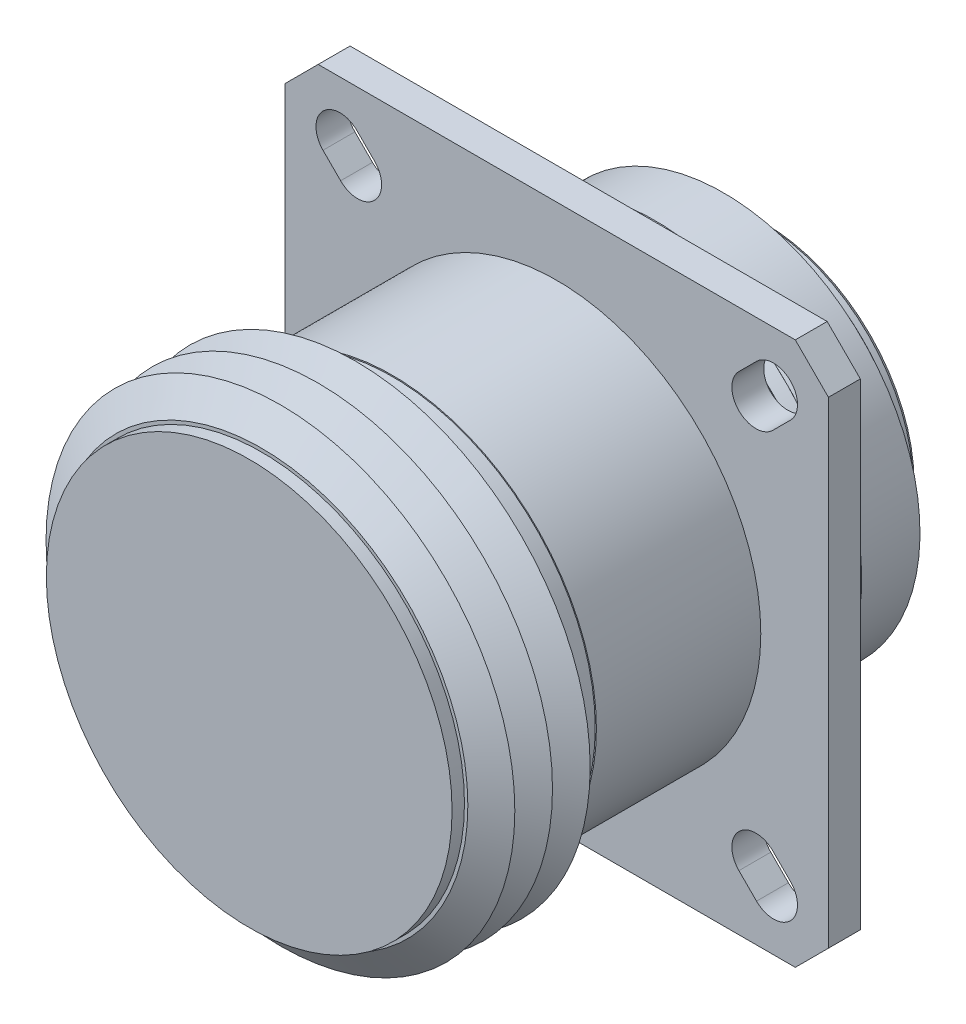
ISO-10303-21;
HEADER;
FILE_DESCRIPTION(('STEP AP214'),'2;1');
FILE_NAME('part.step','',(''),(''),'','','');
FILE_SCHEMA(('AUTOMOTIVE_DESIGN { 1 0 10303 214 1 1 1 1 }'));
ENDSEC;
DATA;
#1=APPLICATION_CONTEXT('core data for automotive mechanical design processes');
#2=APPLICATION_PROTOCOL_DEFINITION('international standard','automotive_design',2000,#1);
#3=PRODUCT_CONTEXT('',#1,'mechanical');
#4=PRODUCT('Part','Part','',(#3));
#5=PRODUCT_RELATED_PRODUCT_CATEGORY('part','',(#4));
#6=PRODUCT_DEFINITION_FORMATION('','',#4);
#7=PRODUCT_DEFINITION_CONTEXT('part definition',#1,'design');
#8=PRODUCT_DEFINITION('design','',#6,#7);
#9=PRODUCT_DEFINITION_SHAPE('','',#8);
#10=(LENGTH_UNIT() NAMED_UNIT(*) SI_UNIT(.MILLI.,.METRE.));
#11=(NAMED_UNIT(*) PLANE_ANGLE_UNIT() SI_UNIT($,.RADIAN.));
#12=(NAMED_UNIT(*) SI_UNIT($,.STERADIAN.) SOLID_ANGLE_UNIT());
#13=UNCERTAINTY_MEASURE_WITH_UNIT(LENGTH_MEASURE(1.E-05),#10,'distance_accuracy_value','');
#14=(GEOMETRIC_REPRESENTATION_CONTEXT(3) GLOBAL_UNCERTAINTY_ASSIGNED_CONTEXT((#13)) GLOBAL_UNIT_ASSIGNED_CONTEXT((#10,
#11,#12)) REPRESENTATION_CONTEXT('',''));
#15=CARTESIAN_POINT('',(0.,0.,0.));
#16=DIRECTION('',(0.,0.,1.));
#17=DIRECTION('',(1.,0.,0.));
#18=AXIS2_PLACEMENT_3D('',#15,#16,#17);
#19=CARTESIAN_POINT('',(0.,0.,-2.159));
#20=DIRECTION('',(0.,0.,1.));
#21=DIRECTION('',(1.,0.,0.));
#22=AXIS2_PLACEMENT_3D('',#19,#20,#21);
#23=PLANE('',#22);
#24=CARTESIAN_POINT('',(-13.4874,13.4874,-2.159));
#25=DIRECTION('',(0.,0.,-1.));
#26=DIRECTION('',(1.,0.,0.));
#27=AXIS2_PLACEMENT_3D('',#24,#25,#26);
#28=CIRCLE('',#27,1.6256);
#29=CARTESIAN_POINT('',(-12.3379272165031,14.6368727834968,-2.159));
#30=VERTEX_POINT('',#29);
#31=CARTESIAN_POINT('',(-14.6368727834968,12.3379272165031,-2.159));
#32=VERTEX_POINT('',#31);
#33=EDGE_CURVE('E205',#30,#32,#28,.T.);
#34=ORIENTED_EDGE('',*,*,#33,.F.);
#35=DIRECTION('',(0.707106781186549,-0.707106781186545,0.));
#36=VECTOR('',#35,1.);
#37=CARTESIAN_POINT('',(-12.3379272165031,14.6368727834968,-2.159));
#38=LINE('',#37,#36);
#39=CARTESIAN_POINT('',(-13.5317272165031,15.8306727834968,-2.159));
#40=VERTEX_POINT('',#39);
#41=EDGE_CURVE('E197',#40,#30,#38,.T.);
#42=ORIENTED_EDGE('',*,*,#41,.F.);
#43=CARTESIAN_POINT('',(-14.6812,14.6812,-2.159));
#44=DIRECTION('',(0.,0.,-1.));
#45=DIRECTION('',(1.,0.,0.));
#46=AXIS2_PLACEMENT_3D('',#43,#44,#45);
#47=CIRCLE('',#46,1.6256);
#48=CARTESIAN_POINT('',(-15.8306727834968,13.5317272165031,-2.159));
#49=VERTEX_POINT('',#48);
#50=EDGE_CURVE('E204',#49,#40,#47,.T.);
#51=ORIENTED_EDGE('',*,*,#50,.F.);
#52=DIRECTION('',(-0.707106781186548,0.707106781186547,0.));
#53=VECTOR('',#52,1.);
#54=CARTESIAN_POINT('',(-14.6368727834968,12.3379272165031,-2.159));
#55=LINE('',#54,#53);
#56=EDGE_CURVE('E209',#32,#49,#55,.T.);
#57=ORIENTED_EDGE('',*,*,#56,.F.);
#58=EDGE_LOOP('',(#34,#42,#51,#57));
#59=FACE_BOUND('',#58,.T.);
#60=DIRECTION('',(0.707106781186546,-0.707106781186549,0.));
#61=VECTOR('',#60,1.);
#62=CARTESIAN_POINT('',(-16.1572359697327,-18.4023,-2.159));
#63=LINE('',#62,#61);
#64=CARTESIAN_POINT('',(-18.4023,-16.1572359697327,-2.159));
#65=VERTEX_POINT('',#64);
#66=CARTESIAN_POINT('',(-16.1572359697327,-18.4023,-2.159));
#67=VERTEX_POINT('',#66);
#68=EDGE_CURVE('E266',#65,#67,#63,.T.);
#69=ORIENTED_EDGE('',*,*,#68,.F.);
#70=DIRECTION('',(0.,-1.,0.));
#71=VECTOR('',#70,1.);
#72=CARTESIAN_POINT('',(-18.4023,18.4023,-2.159));
#73=LINE('',#72,#71);
#74=CARTESIAN_POINT('',(-18.4023,16.1572359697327,-2.159));
#75=VERTEX_POINT('',#74);
#76=EDGE_CURVE('E377',#75,#65,#73,.T.);
#77=ORIENTED_EDGE('',*,*,#76,.F.);
#78=DIRECTION('',(0.707106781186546,0.707106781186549,0.));
#79=VECTOR('',#78,1.);
#80=CARTESIAN_POINT('',(-16.1572359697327,18.4023,-2.159));
#81=LINE('',#80,#79);
#82=CARTESIAN_POINT('',(-16.1572359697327,18.4023,-2.159));
#83=VERTEX_POINT('',#82);
#84=EDGE_CURVE('E350',#75,#83,#81,.T.);
#85=ORIENTED_EDGE('',*,*,#84,.T.);
#86=DIRECTION('',(-1.,0.,0.));
#87=VECTOR('',#86,1.);
#88=CARTESIAN_POINT('',(-18.4023,18.4023,-2.159));
#89=LINE('',#88,#87);
#90=CARTESIAN_POINT('',(16.1572359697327,18.4023,-2.159));
#91=VERTEX_POINT('',#90);
#92=EDGE_CURVE('E373',#91,#83,#89,.T.);
#93=ORIENTED_EDGE('',*,*,#92,.F.);
#94=DIRECTION('',(0.707106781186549,-0.707106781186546,0.));
#95=VECTOR('',#94,1.);
#96=CARTESIAN_POINT('',(16.1572359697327,18.4023,-2.159));
#97=LINE('',#96,#95);
#98=CARTESIAN_POINT('',(18.4023,16.1572359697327,-2.159));
#99=VERTEX_POINT('',#98);
#100=EDGE_CURVE('E360',#91,#99,#97,.T.);
#101=ORIENTED_EDGE('',*,*,#100,.T.);
#102=DIRECTION('',(0.,1.,0.));
#103=VECTOR('',#102,1.);
#104=CARTESIAN_POINT('',(18.4023,18.4023,-2.159));
#105=LINE('',#104,#103);
#106=CARTESIAN_POINT('',(18.4023,-16.1572359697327,-2.159));
#107=VERTEX_POINT('',#106);
#108=EDGE_CURVE('E371',#107,#99,#105,.T.);
#109=ORIENTED_EDGE('',*,*,#108,.F.);
#110=DIRECTION('',(0.707106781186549,0.707106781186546,0.));
#111=VECTOR('',#110,1.);
#112=CARTESIAN_POINT('',(16.1572359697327,-18.4023,-2.159));
#113=LINE('',#112,#111);
#114=CARTESIAN_POINT('',(16.1572359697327,-18.4023,-2.159));
#115=VERTEX_POINT('',#114);
#116=EDGE_CURVE('E276',#115,#107,#113,.T.);
#117=ORIENTED_EDGE('',*,*,#116,.F.);
#118=DIRECTION('',(1.,0.,0.));
#119=VECTOR('',#118,1.);
#120=CARTESIAN_POINT('',(-18.4023,-18.4023,-2.159));
#121=LINE('',#120,#119);
#122=EDGE_CURVE('E44',#67,#115,#121,.T.);
#123=ORIENTED_EDGE('',*,*,#122,.F.);
#124=EDGE_LOOP('',(#69,#77,#85,#93,#101,#109,#117,#123));
#125=FACE_BOUND('',#124,.T.);
#126=DIRECTION('',(-0.707106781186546,0.707106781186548,0.));
#127=VECTOR('',#126,1.);
#128=CARTESIAN_POINT('',(14.6368727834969,-12.3379272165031,-2.159));
#129=LINE('',#128,#127);
#130=CARTESIAN_POINT('',(15.8306727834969,-13.5317272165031,-2.159));
#131=VERTEX_POINT('',#130);
#132=CARTESIAN_POINT('',(14.6368727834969,-12.3379272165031,-2.159));
#133=VERTEX_POINT('',#132);
#134=EDGE_CURVE('E328',#131,#133,#129,.T.);
#135=ORIENTED_EDGE('',*,*,#134,.T.);
#136=CARTESIAN_POINT('',(13.4874,-13.4874,-2.159));
#137=DIRECTION('',(0.,0.,1.));
#138=DIRECTION('',(1.,0.,0.));
#139=AXIS2_PLACEMENT_3D('',#136,#137,#138);
#140=CIRCLE('',#139,1.6256);
#141=CARTESIAN_POINT('',(12.3379272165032,-14.6368727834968,-2.159));
#142=VERTEX_POINT('',#141);
#143=EDGE_CURVE('E318',#133,#142,#140,.T.);
#144=ORIENTED_EDGE('',*,*,#143,.T.);
#145=DIRECTION('',(0.707106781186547,-0.707106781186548,0.));
#146=VECTOR('',#145,1.);
#147=CARTESIAN_POINT('',(12.3379272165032,-14.6368727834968,-2.159));
#148=LINE('',#147,#146);
#149=CARTESIAN_POINT('',(13.5317272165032,-15.8306727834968,-2.159));
#150=VERTEX_POINT('',#149);
#151=EDGE_CURVE('E321',#142,#150,#148,.T.);
#152=ORIENTED_EDGE('',*,*,#151,.T.);
#153=CARTESIAN_POINT('',(14.6812,-14.6812,-2.159));
#154=DIRECTION('',(0.,0.,1.));
#155=DIRECTION('',(1.,0.,0.));
#156=AXIS2_PLACEMENT_3D('',#153,#154,#155);
#157=CIRCLE('',#156,1.6256);
#158=EDGE_CURVE('E325',#150,#131,#157,.T.);
#159=ORIENTED_EDGE('',*,*,#158,.T.);
#160=EDGE_LOOP('',(#135,#144,#152,#159));
#161=FACE_BOUND('',#160,.T.);
#162=DIRECTION('',(0.707106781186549,0.707106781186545,0.));
#163=VECTOR('',#162,1.);
#164=CARTESIAN_POINT('',(-12.3379272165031,-14.6368727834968,-2.159));
#165=LINE('',#164,#163);
#166=CARTESIAN_POINT('',(-13.5317272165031,-15.8306727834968,-2.159));
#167=VERTEX_POINT('',#166);
#168=CARTESIAN_POINT('',(-12.3379272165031,-14.6368727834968,-2.159));
#169=VERTEX_POINT('',#168);
#170=EDGE_CURVE('E296',#167,#169,#165,.T.);
#171=ORIENTED_EDGE('',*,*,#170,.T.);
#172=CARTESIAN_POINT('',(-13.4874,-13.4874,-2.159));
#173=DIRECTION('',(0.,0.,1.));
#174=DIRECTION('',(1.,0.,0.));
#175=AXIS2_PLACEMENT_3D('',#172,#173,#174);
#176=CIRCLE('',#175,1.6256);
#177=CARTESIAN_POINT('',(-14.6368727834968,-12.3379272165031,-2.159));
#178=VERTEX_POINT('',#177);
#179=EDGE_CURVE('E286',#169,#178,#176,.T.);
#180=ORIENTED_EDGE('',*,*,#179,.T.);
#181=DIRECTION('',(-0.707106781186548,-0.707106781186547,0.));
#182=VECTOR('',#181,1.);
#183=CARTESIAN_POINT('',(-14.6368727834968,-12.3379272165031,-2.159));
#184=LINE('',#183,#182);
#185=CARTESIAN_POINT('',(-15.8306727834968,-13.5317272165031,-2.159));
#186=VERTEX_POINT('',#185);
#187=EDGE_CURVE('E289',#178,#186,#184,.T.);
#188=ORIENTED_EDGE('',*,*,#187,.T.);
#189=CARTESIAN_POINT('',(-14.6812,-14.6812,-2.159));
#190=DIRECTION('',(0.,0.,1.));
#191=DIRECTION('',(1.,0.,0.));
#192=AXIS2_PLACEMENT_3D('',#189,#190,#191);
#193=CIRCLE('',#192,1.6256);
#194=EDGE_CURVE('E293',#186,#167,#193,.T.);
#195=ORIENTED_EDGE('',*,*,#194,.T.);
#196=EDGE_LOOP('',(#171,#180,#188,#195));
#197=FACE_BOUND('',#196,.T.);
#198=CARTESIAN_POINT('',(13.4874,13.4874,-2.159));
#199=DIRECTION('',(0.,0.,-1.));
#200=DIRECTION('',(1.,0.,0.));
#201=AXIS2_PLACEMENT_3D('',#198,#199,#200);
#202=CIRCLE('',#201,1.6256);
#203=CARTESIAN_POINT('',(14.6368727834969,12.3379272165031,-2.159));
#204=VERTEX_POINT('',#203);
#205=CARTESIAN_POINT('',(12.3379272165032,14.6368727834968,-2.159));
#206=VERTEX_POINT('',#205);
#207=EDGE_CURVE('E235',#204,#206,#202,.T.);
#208=ORIENTED_EDGE('',*,*,#207,.F.);
#209=DIRECTION('',(-0.707106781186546,-0.707106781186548,0.));
#210=VECTOR('',#209,1.);
#211=CARTESIAN_POINT('',(14.6368727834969,12.3379272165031,-2.159));
#212=LINE('',#211,#210);
#213=CARTESIAN_POINT('',(15.8306727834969,13.5317272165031,-2.159));
#214=VERTEX_POINT('',#213);
#215=EDGE_CURVE('E237',#214,#204,#212,.T.);
#216=ORIENTED_EDGE('',*,*,#215,.F.);
#217=CARTESIAN_POINT('',(14.6812,14.6812,-2.159));
#218=DIRECTION('',(0.,0.,-1.));
#219=DIRECTION('',(1.,0.,0.));
#220=AXIS2_PLACEMENT_3D('',#217,#218,#219);
#221=CIRCLE('',#220,1.6256);
#222=CARTESIAN_POINT('',(13.5317272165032,15.8306727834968,-2.159));
#223=VERTEX_POINT('',#222);
#224=EDGE_CURVE('E240',#223,#214,#221,.T.);
#225=ORIENTED_EDGE('',*,*,#224,.F.);
#226=DIRECTION('',(0.707106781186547,0.707106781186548,0.));
#227=VECTOR('',#226,1.);
#228=CARTESIAN_POINT('',(12.3379272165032,14.6368727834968,-2.159));
#229=LINE('',#228,#227);
#230=EDGE_CURVE('E243',#206,#223,#229,.T.);
#231=ORIENTED_EDGE('',*,*,#230,.F.);
#232=EDGE_LOOP('',(#208,#216,#225,#231));
#233=FACE_BOUND('',#232,.T.);
#234=CARTESIAN_POINT('',(0.,0.,-2.159));
#235=DIRECTION('',(0.,0.,1.));
#236=DIRECTION('',(1.,0.,0.));
#237=AXIS2_PLACEMENT_3D('',#234,#235,#236);
#238=CIRCLE('',#237,14.8148153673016);
#239=CARTESIAN_POINT('',(14.8148153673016,0.,-2.159));
#240=VERTEX_POINT('',#239);
#241=EDGE_CURVE('E11',#240,#240,#238,.F.);
#242=ORIENTED_EDGE('',*,*,#241,.F.);
#243=EDGE_LOOP('',(#242));
#244=FACE_BOUND('',#243,.T.);
#245=ADVANCED_FACE('F36',(#59,#125,#161,#197,#233,#244),#23,.F.);
#246=CARTESIAN_POINT('',(0.,0.,0.));
#247=DIRECTION('',(0.,0.,1.));
#248=DIRECTION('',(1.,0.,0.));
#249=AXIS2_PLACEMENT_3D('',#246,#247,#248);
#250=PLANE('',#249);
#251=DIRECTION('',(0.707106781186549,-0.707106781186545,0.));
#252=VECTOR('',#251,1.);
#253=CARTESIAN_POINT('',(-12.3379272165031,14.6368727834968,0.));
#254=LINE('',#253,#252);
#255=CARTESIAN_POINT('',(-13.5317272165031,15.8306727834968,0.));
#256=VERTEX_POINT('',#255);
#257=CARTESIAN_POINT('',(-12.3379272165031,14.6368727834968,0.));
#258=VERTEX_POINT('',#257);
#259=EDGE_CURVE('E225',#256,#258,#254,.T.);
#260=ORIENTED_EDGE('',*,*,#259,.T.);
#261=CARTESIAN_POINT('',(-13.4874,13.4874,0.));
#262=DIRECTION('',(0.,0.,-1.));
#263=DIRECTION('',(1.,0.,0.));
#264=AXIS2_PLACEMENT_3D('',#261,#262,#263);
#265=CIRCLE('',#264,1.6256);
#266=CARTESIAN_POINT('',(-14.6368727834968,12.3379272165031,0.));
#267=VERTEX_POINT('',#266);
#268=EDGE_CURVE('E59',#258,#267,#265,.T.);
#269=ORIENTED_EDGE('',*,*,#268,.T.);
#270=DIRECTION('',(-0.707106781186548,0.707106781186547,0.));
#271=VECTOR('',#270,1.);
#272=CARTESIAN_POINT('',(-14.6368727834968,12.3379272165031,0.));
#273=LINE('',#272,#271);
#274=CARTESIAN_POINT('',(-15.8306727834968,13.5317272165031,0.));
#275=VERTEX_POINT('',#274);
#276=EDGE_CURVE('E213',#267,#275,#273,.T.);
#277=ORIENTED_EDGE('',*,*,#276,.T.);
#278=CARTESIAN_POINT('',(-14.6812,14.6812,0.));
#279=DIRECTION('',(0.,0.,-1.));
#280=DIRECTION('',(1.,0.,0.));
#281=AXIS2_PLACEMENT_3D('',#278,#279,#280);
#282=CIRCLE('',#281,1.6256);
#283=EDGE_CURVE('E216',#275,#256,#282,.T.);
#284=ORIENTED_EDGE('',*,*,#283,.T.);
#285=EDGE_LOOP('',(#260,#269,#277,#284));
#286=FACE_BOUND('',#285,.T.);
#287=DIRECTION('',(0.,-1.,0.));
#288=VECTOR('',#287,1.);
#289=CARTESIAN_POINT('',(-18.4023,18.4023,0.));
#290=LINE('',#289,#288);
#291=CARTESIAN_POINT('',(-18.4023,16.1572359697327,0.));
#292=VERTEX_POINT('',#291);
#293=CARTESIAN_POINT('',(-18.4023,-16.1572359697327,0.));
#294=VERTEX_POINT('',#293);
#295=EDGE_CURVE('E385',#292,#294,#290,.T.);
#296=ORIENTED_EDGE('',*,*,#295,.T.);
#297=DIRECTION('',(0.707106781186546,-0.707106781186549,0.));
#298=VECTOR('',#297,1.);
#299=CARTESIAN_POINT('',(-16.1572359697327,-18.4023,0.));
#300=LINE('',#299,#298);
#301=CARTESIAN_POINT('',(-16.1572359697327,-18.4023,0.));
#302=VERTEX_POINT('',#301);
#303=EDGE_CURVE('E259',#294,#302,#300,.T.);
#304=ORIENTED_EDGE('',*,*,#303,.T.);
#305=DIRECTION('',(1.,0.,0.));
#306=VECTOR('',#305,1.);
#307=CARTESIAN_POINT('',(-18.4023,-18.4023,0.));
#308=LINE('',#307,#306);
#309=CARTESIAN_POINT('',(16.1572359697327,-18.4023,0.));
#310=VERTEX_POINT('',#309);
#311=EDGE_CURVE('E374',#302,#310,#308,.T.);
#312=ORIENTED_EDGE('',*,*,#311,.T.);
#313=DIRECTION('',(0.707106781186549,0.707106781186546,0.));
#314=VECTOR('',#313,1.);
#315=CARTESIAN_POINT('',(16.1572359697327,-18.4023,0.));
#316=LINE('',#315,#314);
#317=CARTESIAN_POINT('',(18.4023,-16.1572359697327,0.));
#318=VERTEX_POINT('',#317);
#319=EDGE_CURVE('E274',#310,#318,#316,.T.);
#320=ORIENTED_EDGE('',*,*,#319,.T.);
#321=DIRECTION('',(0.,1.,0.));
#322=VECTOR('',#321,1.);
#323=CARTESIAN_POINT('',(18.4023,18.4023,0.));
#324=LINE('',#323,#322);
#325=CARTESIAN_POINT('',(18.4023,16.1572359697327,0.));
#326=VERTEX_POINT('',#325);
#327=EDGE_CURVE('E369',#318,#326,#324,.T.);
#328=ORIENTED_EDGE('',*,*,#327,.T.);
#329=DIRECTION('',(0.707106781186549,-0.707106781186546,0.));
#330=VECTOR('',#329,1.);
#331=CARTESIAN_POINT('',(16.1572359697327,18.4023,0.));
#332=LINE('',#331,#330);
#333=CARTESIAN_POINT('',(16.1572359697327,18.4023,0.));
#334=VERTEX_POINT('',#333);
#335=EDGE_CURVE('E358',#334,#326,#332,.T.);
#336=ORIENTED_EDGE('',*,*,#335,.F.);
#337=DIRECTION('',(-1.,0.,0.));
#338=VECTOR('',#337,1.);
#339=CARTESIAN_POINT('',(-18.4023,18.4023,0.));
#340=LINE('',#339,#338);
#341=CARTESIAN_POINT('',(-16.1572359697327,18.4023,0.));
#342=VERTEX_POINT('',#341);
#343=EDGE_CURVE('E382',#334,#342,#340,.T.);
#344=ORIENTED_EDGE('',*,*,#343,.T.);
#345=DIRECTION('',(0.707106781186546,0.707106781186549,0.));
#346=VECTOR('',#345,1.);
#347=CARTESIAN_POINT('',(-16.1572359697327,18.4023,0.));
#348=LINE('',#347,#346);
#349=EDGE_CURVE('E343',#292,#342,#348,.T.);
#350=ORIENTED_EDGE('',*,*,#349,.F.);
#351=EDGE_LOOP('',(#296,#304,#312,#320,#328,#336,#344,#350));
#352=FACE_BOUND('',#351,.T.);
#353=CARTESIAN_POINT('',(13.4874,-13.4874,0.));
#354=DIRECTION('',(0.,0.,1.));
#355=DIRECTION('',(1.,0.,0.));
#356=AXIS2_PLACEMENT_3D('',#353,#354,#355);
#357=CIRCLE('',#356,1.6256);
#358=CARTESIAN_POINT('',(14.6368727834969,-12.3379272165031,0.));
#359=VERTEX_POINT('',#358);
#360=CARTESIAN_POINT('',(12.3379272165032,-14.6368727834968,0.));
#361=VERTEX_POINT('',#360);
#362=EDGE_CURVE('E311',#359,#361,#357,.T.);
#363=ORIENTED_EDGE('',*,*,#362,.F.);
#364=DIRECTION('',(-0.707106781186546,0.707106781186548,0.));
#365=VECTOR('',#364,1.);
#366=CARTESIAN_POINT('',(14.6368727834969,-12.3379272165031,0.));
#367=LINE('',#366,#365);
#368=CARTESIAN_POINT('',(15.8306727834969,-13.5317272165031,0.));
#369=VERTEX_POINT('',#368);
#370=EDGE_CURVE('E322',#369,#359,#367,.T.);
#371=ORIENTED_EDGE('',*,*,#370,.F.);
#372=CARTESIAN_POINT('',(14.6812,-14.6812,0.));
#373=DIRECTION('',(0.,0.,1.));
#374=DIRECTION('',(1.,0.,0.));
#375=AXIS2_PLACEMENT_3D('',#372,#373,#374);
#376=CIRCLE('',#375,1.6256);
#377=CARTESIAN_POINT('',(13.5317272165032,-15.8306727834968,0.));
#378=VERTEX_POINT('',#377);
#379=EDGE_CURVE('E336',#378,#369,#376,.T.);
#380=ORIENTED_EDGE('',*,*,#379,.F.);
#381=DIRECTION('',(0.707106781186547,-0.707106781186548,0.));
#382=VECTOR('',#381,1.);
#383=CARTESIAN_POINT('',(12.3379272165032,-14.6368727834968,0.));
#384=LINE('',#383,#382);
#385=EDGE_CURVE('E333',#361,#378,#384,.T.);
#386=ORIENTED_EDGE('',*,*,#385,.F.);
#387=EDGE_LOOP('',(#363,#371,#380,#386));
#388=FACE_BOUND('',#387,.T.);
#389=CARTESIAN_POINT('',(-13.4874,-13.4874,0.));
#390=DIRECTION('',(0.,0.,1.));
#391=DIRECTION('',(1.,0.,0.));
#392=AXIS2_PLACEMENT_3D('',#389,#390,#391);
#393=CIRCLE('',#392,1.6256);
#394=CARTESIAN_POINT('',(-12.3379272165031,-14.6368727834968,0.));
#395=VERTEX_POINT('',#394);
#396=CARTESIAN_POINT('',(-14.6368727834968,-12.3379272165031,0.));
#397=VERTEX_POINT('',#396);
#398=EDGE_CURVE('E284',#395,#397,#393,.T.);
#399=ORIENTED_EDGE('',*,*,#398,.F.);
#400=DIRECTION('',(0.707106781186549,0.707106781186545,0.));
#401=VECTOR('',#400,1.);
#402=CARTESIAN_POINT('',(-12.3379272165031,-14.6368727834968,0.));
#403=LINE('',#402,#401);
#404=CARTESIAN_POINT('',(-13.5317272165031,-15.8306727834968,0.));
#405=VERTEX_POINT('',#404);
#406=EDGE_CURVE('E290',#405,#395,#403,.T.);
#407=ORIENTED_EDGE('',*,*,#406,.F.);
#408=CARTESIAN_POINT('',(-14.6812,-14.6812,0.));
#409=DIRECTION('',(0.,0.,1.));
#410=DIRECTION('',(1.,0.,0.));
#411=AXIS2_PLACEMENT_3D('',#408,#409,#410);
#412=CIRCLE('',#411,1.6256);
#413=CARTESIAN_POINT('',(-15.8306727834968,-13.5317272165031,0.));
#414=VERTEX_POINT('',#413);
#415=EDGE_CURVE('E304',#414,#405,#412,.T.);
#416=ORIENTED_EDGE('',*,*,#415,.F.);
#417=DIRECTION('',(-0.707106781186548,-0.707106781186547,0.));
#418=VECTOR('',#417,1.);
#419=CARTESIAN_POINT('',(-14.6368727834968,-12.3379272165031,0.));
#420=LINE('',#419,#418);
#421=EDGE_CURVE('E301',#397,#414,#420,.T.);
#422=ORIENTED_EDGE('',*,*,#421,.F.);
#423=EDGE_LOOP('',(#399,#407,#416,#422));
#424=FACE_BOUND('',#423,.T.);
#425=DIRECTION('',(-0.707106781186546,-0.707106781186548,0.));
#426=VECTOR('',#425,1.);
#427=CARTESIAN_POINT('',(14.6368727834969,12.3379272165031,0.));
#428=LINE('',#427,#426);
#429=CARTESIAN_POINT('',(15.8306727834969,13.5317272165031,0.));
#430=VERTEX_POINT('',#429);
#431=CARTESIAN_POINT('',(14.6368727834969,12.3379272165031,0.));
#432=VERTEX_POINT('',#431);
#433=EDGE_CURVE('E248',#430,#432,#428,.T.);
#434=ORIENTED_EDGE('',*,*,#433,.T.);
#435=CARTESIAN_POINT('',(13.4874,13.4874,0.));
#436=DIRECTION('',(0.,0.,-1.));
#437=DIRECTION('',(1.,0.,0.));
#438=AXIS2_PLACEMENT_3D('',#435,#436,#437);
#439=CIRCLE('',#438,1.6256);
#440=CARTESIAN_POINT('',(12.3379272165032,14.6368727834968,0.));
#441=VERTEX_POINT('',#440);
#442=EDGE_CURVE('E231',#432,#441,#439,.T.);
#443=ORIENTED_EDGE('',*,*,#442,.T.);
#444=DIRECTION('',(0.707106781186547,0.707106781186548,0.));
#445=VECTOR('',#444,1.);
#446=CARTESIAN_POINT('',(12.3379272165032,14.6368727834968,0.));
#447=LINE('',#446,#445);
#448=CARTESIAN_POINT('',(13.5317272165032,15.8306727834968,0.));
#449=VERTEX_POINT('',#448);
#450=EDGE_CURVE('E238',#441,#449,#447,.T.);
#451=ORIENTED_EDGE('',*,*,#450,.T.);
#452=CARTESIAN_POINT('',(14.6812,14.6812,0.));
#453=DIRECTION('',(0.,0.,-1.));
#454=DIRECTION('',(1.,0.,0.));
#455=AXIS2_PLACEMENT_3D('',#452,#453,#454);
#456=CIRCLE('',#455,1.6256);
#457=EDGE_CURVE('E251',#449,#430,#456,.T.);
#458=ORIENTED_EDGE('',*,*,#457,.T.);
#459=EDGE_LOOP('',(#434,#443,#451,#458));
#460=FACE_BOUND('',#459,.T.);
#461=CARTESIAN_POINT('',(0.,0.,0.));
#462=DIRECTION('',(0.,0.,1.));
#463=DIRECTION('',(1.,0.,0.));
#464=AXIS2_PLACEMENT_3D('',#461,#462,#463);
#465=CIRCLE('',#464,13.820358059);
#466=CARTESIAN_POINT('',(13.820358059,0.,0.));
#467=VERTEX_POINT('',#466);
#468=EDGE_CURVE('E219',#467,#467,#465,.T.);
#469=ORIENTED_EDGE('',*,*,#468,.F.);
#470=EDGE_LOOP('',(#469));
#471=FACE_BOUND('',#470,.T.);
#472=ADVANCED_FACE('F390',(#286,#352,#388,#424,#460,#471),#250,.T.);
#473=CARTESIAN_POINT('',(-18.4023,-18.4023,-2.159));
#474=DIRECTION('',(0.,-1.,0.));
#475=DIRECTION('',(1.,0.,0.));
#476=AXIS2_PLACEMENT_3D('',#473,#474,#475);
#477=PLANE('',#476);
#478=ORIENTED_EDGE('',*,*,#311,.F.);
#479=DIRECTION('',(0.,0.,1.));
#480=VECTOR('',#479,1.);
#481=CARTESIAN_POINT('',(-16.1572359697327,-18.4023,-2.159));
#482=LINE('',#481,#480);
#483=EDGE_CURVE('E268',#67,#302,#482,.T.);
#484=ORIENTED_EDGE('',*,*,#483,.F.);
#485=ORIENTED_EDGE('',*,*,#122,.T.);
#486=DIRECTION('',(0.,0.,1.));
#487=VECTOR('',#486,1.);
#488=CARTESIAN_POINT('',(16.1572359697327,-18.4023,-2.159));
#489=LINE('',#488,#487);
#490=EDGE_CURVE('E281',#115,#310,#489,.T.);
#491=ORIENTED_EDGE('',*,*,#490,.T.);
#492=EDGE_LOOP('',(#478,#484,#485,#491));
#493=FACE_BOUND('',#492,.T.);
#494=ADVANCED_FACE('F400',(#493),#477,.T.);
#495=CARTESIAN_POINT('',(-18.4023,18.4023,-2.159));
#496=DIRECTION('',(-1.,0.,0.));
#497=DIRECTION('',(0.,-1.,0.));
#498=AXIS2_PLACEMENT_3D('',#495,#496,#497);
#499=PLANE('',#498);
#500=ORIENTED_EDGE('',*,*,#76,.T.);
#501=DIRECTION('',(0.,0.,1.));
#502=VECTOR('',#501,1.);
#503=CARTESIAN_POINT('',(-18.4023,-16.1572359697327,-2.159));
#504=LINE('',#503,#502);
#505=EDGE_CURVE('E271',#65,#294,#504,.T.);
#506=ORIENTED_EDGE('',*,*,#505,.T.);
#507=ORIENTED_EDGE('',*,*,#295,.F.);
#508=DIRECTION('',(0.,0.,1.));
#509=VECTOR('',#508,1.);
#510=CARTESIAN_POINT('',(-18.4023,16.1572359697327,-2.159));
#511=LINE('',#510,#509);
#512=EDGE_CURVE('E353',#75,#292,#511,.T.);
#513=ORIENTED_EDGE('',*,*,#512,.F.);
#514=EDGE_LOOP('',(#500,#506,#507,#513));
#515=FACE_BOUND('',#514,.T.);
#516=ADVANCED_FACE('F422',(#515),#499,.T.);
#517=CARTESIAN_POINT('',(18.4023,18.4023,-2.159));
#518=DIRECTION('',(1.,0.,0.));
#519=DIRECTION('',(0.,1.,0.));
#520=AXIS2_PLACEMENT_3D('',#517,#518,#519);
#521=PLANE('',#520);
#522=ORIENTED_EDGE('',*,*,#327,.F.);
#523=DIRECTION('',(0.,0.,1.));
#524=VECTOR('',#523,1.);
#525=CARTESIAN_POINT('',(18.4023,-16.1572359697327,-2.159));
#526=LINE('',#525,#524);
#527=EDGE_CURVE('E278',#107,#318,#526,.T.);
#528=ORIENTED_EDGE('',*,*,#527,.F.);
#529=ORIENTED_EDGE('',*,*,#108,.T.);
#530=DIRECTION('',(0.,0.,1.));
#531=VECTOR('',#530,1.);
#532=CARTESIAN_POINT('',(18.4023,16.1572359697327,-2.159));
#533=LINE('',#532,#531);
#534=EDGE_CURVE('E366',#99,#326,#533,.T.);
#535=ORIENTED_EDGE('',*,*,#534,.T.);
#536=EDGE_LOOP('',(#522,#528,#529,#535));
#537=FACE_BOUND('',#536,.T.);
#538=ADVANCED_FACE('F38',(#537),#521,.T.);
#539=CARTESIAN_POINT('',(-18.4023,18.4023,-2.159));
#540=DIRECTION('',(0.,1.,0.));
#541=DIRECTION('',(-1.,0.,0.));
#542=AXIS2_PLACEMENT_3D('',#539,#540,#541);
#543=PLANE('',#542);
#544=DIRECTION('',(0.,0.,1.));
#545=VECTOR('',#544,1.);
#546=CARTESIAN_POINT('',(-16.1572359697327,18.4023,-2.159));
#547=LINE('',#546,#545);
#548=EDGE_CURVE('E355',#83,#342,#547,.T.);
#549=ORIENTED_EDGE('',*,*,#548,.T.);
#550=ORIENTED_EDGE('',*,*,#343,.F.);
#551=DIRECTION('',(0.,0.,1.));
#552=VECTOR('',#551,1.);
#553=CARTESIAN_POINT('',(16.1572359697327,18.4023,-2.159));
#554=LINE('',#553,#552);
#555=EDGE_CURVE('E363',#91,#334,#554,.T.);
#556=ORIENTED_EDGE('',*,*,#555,.F.);
#557=ORIENTED_EDGE('',*,*,#92,.T.);
#558=EDGE_LOOP('',(#549,#550,#556,#557));
#559=FACE_BOUND('',#558,.T.);
#560=ADVANCED_FACE('F415',(#559),#543,.T.);
#561=CARTESIAN_POINT('',(16.1572359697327,18.4023,-2.159));
#562=DIRECTION('',(-0.707106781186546,-0.707106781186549,0.));
#563=DIRECTION('',(0.707106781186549,-0.707106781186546,0.));
#564=AXIS2_PLACEMENT_3D('',#561,#562,#563);
#565=PLANE('',#564);
#566=ORIENTED_EDGE('',*,*,#335,.T.);
#567=ORIENTED_EDGE('',*,*,#534,.F.);
#568=ORIENTED_EDGE('',*,*,#100,.F.);
#569=ORIENTED_EDGE('',*,*,#555,.T.);
#570=EDGE_LOOP('',(#566,#567,#568,#569));
#571=FACE_BOUND('',#570,.T.);
#572=ADVANCED_FACE('F411',(#571),#565,.F.);
#573=CARTESIAN_POINT('',(-16.1572359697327,18.4023,-2.159));
#574=DIRECTION('',(0.707106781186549,-0.707106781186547,0.));
#575=DIRECTION('',(0.707106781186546,0.707106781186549,0.));
#576=AXIS2_PLACEMENT_3D('',#573,#574,#575);
#577=PLANE('',#576);
#578=ORIENTED_EDGE('',*,*,#349,.T.);
#579=ORIENTED_EDGE('',*,*,#548,.F.);
#580=ORIENTED_EDGE('',*,*,#84,.F.);
#581=ORIENTED_EDGE('',*,*,#512,.T.);
#582=EDGE_LOOP('',(#578,#579,#580,#581));
#583=FACE_BOUND('',#582,.T.);
#584=ADVANCED_FACE('F418',(#583),#577,.F.);
#585=CARTESIAN_POINT('',(13.4874,-13.4874,-2.159));
#586=DIRECTION('',(0.,0.,1.));
#587=DIRECTION('',(1.,0.,0.));
#588=AXIS2_PLACEMENT_3D('',#585,#586,#587);
#589=CYLINDRICAL_SURFACE('',#588,1.6256);
#590=ORIENTED_EDGE('',*,*,#362,.T.);
#591=DIRECTION('',(0.,0.,1.));
#592=VECTOR('',#591,1.);
#593=CARTESIAN_POINT('',(12.3379272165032,-14.6368727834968,-2.159));
#594=LINE('',#593,#592);
#595=EDGE_CURVE('E331',#142,#361,#594,.T.);
#596=ORIENTED_EDGE('',*,*,#595,.F.);
#597=ORIENTED_EDGE('',*,*,#143,.F.);
#598=DIRECTION('',(0.,0.,1.));
#599=VECTOR('',#598,1.);
#600=CARTESIAN_POINT('',(14.6368727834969,-12.3379272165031,-2.159));
#601=LINE('',#600,#599);
#602=EDGE_CURVE('E341',#133,#359,#601,.T.);
#603=ORIENTED_EDGE('',*,*,#602,.T.);
#604=EDGE_LOOP('',(#590,#596,#597,#603));
#605=FACE_BOUND('',#604,.T.);
#606=ADVANCED_FACE('F1047',(#605),#589,.F.);
#607=CARTESIAN_POINT('',(14.6368727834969,-12.3379272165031,-2.159));
#608=DIRECTION('',(0.707106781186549,0.707106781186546,0.));
#609=DIRECTION('',(-0.707106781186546,0.707106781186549,0.));
#610=AXIS2_PLACEMENT_3D('',#607,#608,#609);
#611=PLANE('',#610);
#612=ORIENTED_EDGE('',*,*,#370,.T.);
#613=ORIENTED_EDGE('',*,*,#602,.F.);
#614=ORIENTED_EDGE('',*,*,#134,.F.);
#615=DIRECTION('',(0.,0.,1.));
#616=VECTOR('',#615,1.);
#617=CARTESIAN_POINT('',(15.8306727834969,-13.5317272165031,-2.159));
#618=LINE('',#617,#616);
#619=EDGE_CURVE('E344',#131,#369,#618,.T.);
#620=ORIENTED_EDGE('',*,*,#619,.T.);
#621=EDGE_LOOP('',(#612,#613,#614,#620));
#622=FACE_BOUND('',#621,.T.);
#623=ADVANCED_FACE('F1038',(#622),#611,.F.);
#624=CARTESIAN_POINT('',(14.6812,-14.6812,-2.159));
#625=DIRECTION('',(0.,0.,1.));
#626=DIRECTION('',(1.,0.,0.));
#627=AXIS2_PLACEMENT_3D('',#624,#625,#626);
#628=CYLINDRICAL_SURFACE('',#627,1.6256);
#629=ORIENTED_EDGE('',*,*,#379,.T.);
#630=ORIENTED_EDGE('',*,*,#619,.F.);
#631=ORIENTED_EDGE('',*,*,#158,.F.);
#632=DIRECTION('',(0.,0.,1.));
#633=VECTOR('',#632,1.);
#634=CARTESIAN_POINT('',(13.5317272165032,-15.8306727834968,-2.159));
#635=LINE('',#634,#633);
#636=EDGE_CURVE('E346',#150,#378,#635,.T.);
#637=ORIENTED_EDGE('',*,*,#636,.T.);
#638=EDGE_LOOP('',(#629,#630,#631,#637));
#639=FACE_BOUND('',#638,.T.);
#640=ADVANCED_FACE('F1029',(#639),#628,.F.);
#641=CARTESIAN_POINT('',(12.3379272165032,-14.6368727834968,-2.159));
#642=DIRECTION('',(-0.707106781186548,-0.707106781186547,0.));
#643=DIRECTION('',(0.707106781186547,-0.707106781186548,0.));
#644=AXIS2_PLACEMENT_3D('',#641,#642,#643);
#645=PLANE('',#644);
#646=ORIENTED_EDGE('',*,*,#385,.T.);
#647=ORIENTED_EDGE('',*,*,#636,.F.);
#648=ORIENTED_EDGE('',*,*,#151,.F.);
#649=ORIENTED_EDGE('',*,*,#595,.T.);
#650=EDGE_LOOP('',(#646,#647,#648,#649));
#651=FACE_BOUND('',#650,.T.);
#652=ADVANCED_FACE('F1020',(#651),#645,.F.);
#653=CARTESIAN_POINT('',(-13.4874,-13.4874,-2.159));
#654=DIRECTION('',(0.,0.,1.));
#655=DIRECTION('',(1.,0.,0.));
#656=AXIS2_PLACEMENT_3D('',#653,#654,#655);
#657=CYLINDRICAL_SURFACE('',#656,1.6256);
#658=ORIENTED_EDGE('',*,*,#398,.T.);
#659=DIRECTION('',(0.,0.,1.));
#660=VECTOR('',#659,1.);
#661=CARTESIAN_POINT('',(-14.6368727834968,-12.3379272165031,-2.159));
#662=LINE('',#661,#660);
#663=EDGE_CURVE('E299',#178,#397,#662,.T.);
#664=ORIENTED_EDGE('',*,*,#663,.F.);
#665=ORIENTED_EDGE('',*,*,#179,.F.);
#666=DIRECTION('',(0.,0.,1.));
#667=VECTOR('',#666,1.);
#668=CARTESIAN_POINT('',(-12.3379272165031,-14.6368727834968,-2.159));
#669=LINE('',#668,#667);
#670=EDGE_CURVE('E309',#169,#395,#669,.T.);
#671=ORIENTED_EDGE('',*,*,#670,.T.);
#672=EDGE_LOOP('',(#658,#664,#665,#671));
#673=FACE_BOUND('',#672,.T.);
#674=ADVANCED_FACE('F1011',(#673),#657,.F.);
#675=CARTESIAN_POINT('',(-12.3379272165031,-14.6368727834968,-2.159));
#676=DIRECTION('',(0.707106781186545,-0.70710678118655,0.));
#677=DIRECTION('',(0.70710678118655,0.707106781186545,0.));
#678=AXIS2_PLACEMENT_3D('',#675,#676,#677);
#679=PLANE('',#678);
#680=ORIENTED_EDGE('',*,*,#406,.T.);
#681=ORIENTED_EDGE('',*,*,#670,.F.);
#682=ORIENTED_EDGE('',*,*,#170,.F.);
#683=DIRECTION('',(0.,0.,1.));
#684=VECTOR('',#683,1.);
#685=CARTESIAN_POINT('',(-13.5317272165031,-15.8306727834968,-2.159));
#686=LINE('',#685,#684);
#687=EDGE_CURVE('E312',#167,#405,#686,.T.);
#688=ORIENTED_EDGE('',*,*,#687,.T.);
#689=EDGE_LOOP('',(#680,#681,#682,#688));
#690=FACE_BOUND('',#689,.T.);
#691=ADVANCED_FACE('F1002',(#690),#679,.F.);
#692=CARTESIAN_POINT('',(-14.6812,-14.6812,-2.159));
#693=DIRECTION('',(0.,0.,1.));
#694=DIRECTION('',(1.,0.,0.));
#695=AXIS2_PLACEMENT_3D('',#692,#693,#694);
#696=CYLINDRICAL_SURFACE('',#695,1.6256);
#697=ORIENTED_EDGE('',*,*,#415,.T.);
#698=ORIENTED_EDGE('',*,*,#687,.F.);
#699=ORIENTED_EDGE('',*,*,#194,.F.);
#700=DIRECTION('',(0.,0.,1.));
#701=VECTOR('',#700,1.);
#702=CARTESIAN_POINT('',(-15.8306727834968,-13.5317272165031,-2.159));
#703=LINE('',#702,#701);
#704=EDGE_CURVE('E314',#186,#414,#703,.T.);
#705=ORIENTED_EDGE('',*,*,#704,.T.);
#706=EDGE_LOOP('',(#697,#698,#699,#705));
#707=FACE_BOUND('',#706,.T.);
#708=ADVANCED_FACE('F993',(#707),#696,.F.);
#709=CARTESIAN_POINT('',(-14.6368727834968,-12.3379272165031,-2.159));
#710=DIRECTION('',(-0.707106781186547,0.707106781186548,0.));
#711=DIRECTION('',(-0.707106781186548,-0.707106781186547,0.));
#712=AXIS2_PLACEMENT_3D('',#709,#710,#711);
#713=PLANE('',#712);
#714=ORIENTED_EDGE('',*,*,#421,.T.);
#715=ORIENTED_EDGE('',*,*,#704,.F.);
#716=ORIENTED_EDGE('',*,*,#187,.F.);
#717=ORIENTED_EDGE('',*,*,#663,.T.);
#718=EDGE_LOOP('',(#714,#715,#716,#717));
#719=FACE_BOUND('',#718,.T.);
#720=ADVANCED_FACE('F435',(#719),#713,.F.);
#721=CARTESIAN_POINT('',(16.1572359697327,-18.4023,-2.159));
#722=DIRECTION('',(0.707106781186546,-0.707106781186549,0.));
#723=DIRECTION('',(0.707106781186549,0.707106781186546,0.));
#724=AXIS2_PLACEMENT_3D('',#721,#722,#723);
#725=PLANE('',#724);
#726=ORIENTED_EDGE('',*,*,#319,.F.);
#727=ORIENTED_EDGE('',*,*,#490,.F.);
#728=ORIENTED_EDGE('',*,*,#116,.T.);
#729=ORIENTED_EDGE('',*,*,#527,.T.);
#730=EDGE_LOOP('',(#726,#727,#728,#729));
#731=FACE_BOUND('',#730,.T.);
#732=ADVANCED_FACE('F397',(#731),#725,.T.);
#733=CARTESIAN_POINT('',(-16.1572359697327,-18.4023,-2.159));
#734=DIRECTION('',(-0.707106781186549,-0.707106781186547,0.));
#735=DIRECTION('',(0.707106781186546,-0.707106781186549,0.));
#736=AXIS2_PLACEMENT_3D('',#733,#734,#735);
#737=PLANE('',#736);
#738=ORIENTED_EDGE('',*,*,#303,.F.);
#739=ORIENTED_EDGE('',*,*,#505,.F.);
#740=ORIENTED_EDGE('',*,*,#68,.T.);
#741=ORIENTED_EDGE('',*,*,#483,.T.);
#742=EDGE_LOOP('',(#738,#739,#740,#741));
#743=FACE_BOUND('',#742,.T.);
#744=ADVANCED_FACE('F424',(#743),#737,.T.);
#745=CARTESIAN_POINT('',(13.4874,13.4874,-2.159));
#746=DIRECTION('',(0.,0.,1.));
#747=DIRECTION('',(1.,0.,0.));
#748=AXIS2_PLACEMENT_3D('',#745,#746,#747);
#749=CYLINDRICAL_SURFACE('',#748,1.6256);
#750=ORIENTED_EDGE('',*,*,#442,.F.);
#751=DIRECTION('',(0.,0.,1.));
#752=VECTOR('',#751,1.);
#753=CARTESIAN_POINT('',(14.6368727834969,12.3379272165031,-2.159));
#754=LINE('',#753,#752);
#755=EDGE_CURVE('E245',#204,#432,#754,.T.);
#756=ORIENTED_EDGE('',*,*,#755,.F.);
#757=ORIENTED_EDGE('',*,*,#207,.T.);
#758=DIRECTION('',(0.,0.,1.));
#759=VECTOR('',#758,1.);
#760=CARTESIAN_POINT('',(12.3379272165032,14.6368727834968,-2.159));
#761=LINE('',#760,#759);
#762=EDGE_CURVE('E256',#206,#441,#761,.T.);
#763=ORIENTED_EDGE('',*,*,#762,.T.);
#764=EDGE_LOOP('',(#750,#756,#757,#763));
#765=FACE_BOUND('',#764,.T.);
#766=ADVANCED_FACE('F426',(#765),#749,.F.);
#767=CARTESIAN_POINT('',(12.3379272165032,14.6368727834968,-2.159));
#768=DIRECTION('',(0.707106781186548,-0.707106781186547,0.));
#769=DIRECTION('',(0.707106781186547,0.707106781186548,0.));
#770=AXIS2_PLACEMENT_3D('',#767,#768,#769);
#771=PLANE('',#770);
#772=ORIENTED_EDGE('',*,*,#450,.F.);
#773=ORIENTED_EDGE('',*,*,#762,.F.);
#774=ORIENTED_EDGE('',*,*,#230,.T.);
#775=DIRECTION('',(0.,0.,1.));
#776=VECTOR('',#775,1.);
#777=CARTESIAN_POINT('',(13.5317272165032,15.8306727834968,-2.159));
#778=LINE('',#777,#776);
#779=EDGE_CURVE('E260',#223,#449,#778,.T.);
#780=ORIENTED_EDGE('',*,*,#779,.T.);
#781=EDGE_LOOP('',(#772,#773,#774,#780));
#782=FACE_BOUND('',#781,.T.);
#783=ADVANCED_FACE('F432',(#782),#771,.T.);
#784=CARTESIAN_POINT('',(14.6812,14.6812,-2.159));
#785=DIRECTION('',(0.,0.,1.));
#786=DIRECTION('',(1.,0.,0.));
#787=AXIS2_PLACEMENT_3D('',#784,#785,#786);
#788=CYLINDRICAL_SURFACE('',#787,1.6256);
#789=ORIENTED_EDGE('',*,*,#457,.F.);
#790=ORIENTED_EDGE('',*,*,#779,.F.);
#791=ORIENTED_EDGE('',*,*,#224,.T.);
#792=DIRECTION('',(0.,0.,1.));
#793=VECTOR('',#792,1.);
#794=CARTESIAN_POINT('',(15.8306727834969,13.5317272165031,-2.159));
#795=LINE('',#794,#793);
#796=EDGE_CURVE('E262',#214,#430,#795,.T.);
#797=ORIENTED_EDGE('',*,*,#796,.T.);
#798=EDGE_LOOP('',(#789,#790,#791,#797));
#799=FACE_BOUND('',#798,.T.);
#800=ADVANCED_FACE('F786',(#799),#788,.F.);
#801=CARTESIAN_POINT('',(14.6368727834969,12.3379272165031,-2.159));
#802=DIRECTION('',(-0.707106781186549,0.707106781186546,0.));
#803=DIRECTION('',(-0.707106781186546,-0.707106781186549,0.));
#804=AXIS2_PLACEMENT_3D('',#801,#802,#803);
#805=PLANE('',#804);
#806=ORIENTED_EDGE('',*,*,#433,.F.);
#807=ORIENTED_EDGE('',*,*,#796,.F.);
#808=ORIENTED_EDGE('',*,*,#215,.T.);
#809=ORIENTED_EDGE('',*,*,#755,.T.);
#810=EDGE_LOOP('',(#806,#807,#808,#809));
#811=FACE_BOUND('',#810,.T.);
#812=ADVANCED_FACE('F783',(#811),#805,.T.);
#813=CARTESIAN_POINT('',(-13.4874,13.4874,-2.159));
#814=DIRECTION('',(0.,0.,1.));
#815=DIRECTION('',(1.,0.,0.));
#816=AXIS2_PLACEMENT_3D('',#813,#814,#815);
#817=CYLINDRICAL_SURFACE('',#816,1.6256);
#818=ORIENTED_EDGE('',*,*,#268,.F.);
#819=DIRECTION('',(0.,0.,1.));
#820=VECTOR('',#819,1.);
#821=CARTESIAN_POINT('',(-12.3379272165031,14.6368727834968,-2.159));
#822=LINE('',#821,#820);
#823=EDGE_CURVE('E199',#30,#258,#822,.T.);
#824=ORIENTED_EDGE('',*,*,#823,.F.);
#825=ORIENTED_EDGE('',*,*,#33,.T.);
#826=DIRECTION('',(0.,0.,1.));
#827=VECTOR('',#826,1.);
#828=CARTESIAN_POINT('',(-14.6368727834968,12.3379272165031,-2.159));
#829=LINE('',#828,#827);
#830=EDGE_CURVE('E229',#32,#267,#829,.T.);
#831=ORIENTED_EDGE('',*,*,#830,.T.);
#832=EDGE_LOOP('',(#818,#824,#825,#831));
#833=FACE_BOUND('',#832,.T.);
#834=ADVANCED_FACE('F207',(#833),#817,.F.);
#835=CARTESIAN_POINT('',(-14.6368727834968,12.3379272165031,-2.159));
#836=DIRECTION('',(0.707106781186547,0.707106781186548,0.));
#837=DIRECTION('',(-0.707106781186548,0.707106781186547,0.));
#838=AXIS2_PLACEMENT_3D('',#835,#836,#837);
#839=PLANE('',#838);
#840=ORIENTED_EDGE('',*,*,#276,.F.);
#841=ORIENTED_EDGE('',*,*,#830,.F.);
#842=ORIENTED_EDGE('',*,*,#56,.T.);
#843=DIRECTION('',(0.,0.,1.));
#844=VECTOR('',#843,1.);
#845=CARTESIAN_POINT('',(-15.8306727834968,13.5317272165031,-2.159));
#846=LINE('',#845,#844);
#847=EDGE_CURVE('E232',#49,#275,#846,.T.);
#848=ORIENTED_EDGE('',*,*,#847,.T.);
#849=EDGE_LOOP('',(#840,#841,#842,#848));
#850=FACE_BOUND('',#849,.T.);
#851=ADVANCED_FACE('F772',(#850),#839,.T.);
#852=CARTESIAN_POINT('',(-14.6812,14.6812,-2.159));
#853=DIRECTION('',(0.,0.,1.));
#854=DIRECTION('',(1.,0.,0.));
#855=AXIS2_PLACEMENT_3D('',#852,#853,#854);
#856=CYLINDRICAL_SURFACE('',#855,1.6256);
#857=ORIENTED_EDGE('',*,*,#283,.F.);
#858=ORIENTED_EDGE('',*,*,#847,.F.);
#859=ORIENTED_EDGE('',*,*,#50,.T.);
#860=DIRECTION('',(0.,0.,1.));
#861=VECTOR('',#860,1.);
#862=CARTESIAN_POINT('',(-13.5317272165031,15.8306727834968,-2.159));
#863=LINE('',#862,#861);
#864=EDGE_CURVE('E51',#40,#256,#863,.T.);
#865=ORIENTED_EDGE('',*,*,#864,.T.);
#866=EDGE_LOOP('',(#857,#858,#859,#865));
#867=FACE_BOUND('',#866,.T.);
#868=ADVANCED_FACE('F775',(#867),#856,.F.);
#869=CARTESIAN_POINT('',(-12.3379272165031,14.6368727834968,-2.159));
#870=DIRECTION('',(-0.707106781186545,-0.70710678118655,0.));
#871=DIRECTION('',(0.70710678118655,-0.707106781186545,0.));
#872=AXIS2_PLACEMENT_3D('',#869,#870,#871);
#873=PLANE('',#872);
#874=ORIENTED_EDGE('',*,*,#259,.F.);
#875=ORIENTED_EDGE('',*,*,#864,.F.);
#876=ORIENTED_EDGE('',*,*,#41,.T.);
#877=ORIENTED_EDGE('',*,*,#823,.T.);
#878=EDGE_LOOP('',(#874,#875,#876,#877));
#879=FACE_BOUND('',#878,.T.);
#880=ADVANCED_FACE('F198',(#879),#873,.T.);
#881=CARTESIAN_POINT('',(0.,0.,0.));
#882=DIRECTION('',(0.,0.,1.));
#883=DIRECTION('',(1.,0.,0.));
#884=AXIS2_PLACEMENT_3D('',#881,#882,#883);
#885=CYLINDRICAL_SURFACE('',#884,13.820358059);
#886=CARTESIAN_POINT('',(0.,0.,11.132628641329));
#887=DIRECTION('',(0.,0.,1.));
#888=DIRECTION('',(1.,0.,0.));
#889=AXIS2_PLACEMENT_3D('',#886,#887,#888);
#890=CIRCLE('',#889,13.820358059);
#891=CARTESIAN_POINT('',(13.820358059,0.,11.132628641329));
#892=VERTEX_POINT('',#891);
#893=EDGE_CURVE('E852',#892,#892,#890,.T.);
#894=ORIENTED_EDGE('',*,*,#893,.F.);
#895=EDGE_LOOP('',(#894));
#896=FACE_BOUND('',#895,.T.);
#897=ORIENTED_EDGE('',*,*,#468,.T.);
#898=EDGE_LOOP('',(#897));
#899=FACE_BOUND('',#898,.T.);
#900=ADVANCED_FACE('F482',(#896,#899),#885,.T.);
#901=CARTESIAN_POINT('',(0.,13.820358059,11.132628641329));
#902=DIRECTION('',(0.,0.,-1.));
#903=DIRECTION('',(-1.,0.,0.));
#904=AXIS2_PLACEMENT_3D('',#901,#902,#903);
#905=PLANE('',#904);
#906=CARTESIAN_POINT('',(0.,0.,11.132628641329));
#907=DIRECTION('',(0.,0.,1.));
#908=DIRECTION('',(1.,0.,0.));
#909=AXIS2_PLACEMENT_3D('',#906,#907,#908);
#910=CIRCLE('',#909,13.74015413);
#911=CARTESIAN_POINT('',(13.74015413,0.,11.132628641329));
#912=VERTEX_POINT('',#911);
#913=EDGE_CURVE('E850',#912,#912,#910,.T.);
#914=ORIENTED_EDGE('',*,*,#913,.F.);
#915=EDGE_LOOP('',(#914));
#916=FACE_BOUND('',#915,.T.);
#917=ORIENTED_EDGE('',*,*,#893,.T.);
#918=EDGE_LOOP('',(#917));
#919=FACE_BOUND('',#918,.T.);
#920=ADVANCED_FACE('F486',(#916,#919),#905,.F.);
#921=CARTESIAN_POINT('',(0.,0.,0.));
#922=DIRECTION('',(0.,0.,1.));
#923=DIRECTION('',(1.,0.,0.));
#924=AXIS2_PLACEMENT_3D('',#921,#922,#923);
#925=CYLINDRICAL_SURFACE('',#924,13.74015413);
#926=CARTESIAN_POINT('',(0.,0.,12.3349755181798));
#927=DIRECTION('',(0.,0.,1.));
#928=DIRECTION('',(1.,0.,0.));
#929=AXIS2_PLACEMENT_3D('',#926,#927,#928);
#930=CIRCLE('',#929,13.74015413);
#931=CARTESIAN_POINT('',(13.74015413,0.,12.3349755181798));
#932=VERTEX_POINT('',#931);
#933=EDGE_CURVE('E847',#932,#932,#930,.T.);
#934=ORIENTED_EDGE('',*,*,#933,.F.);
#935=EDGE_LOOP('',(#934));
#936=FACE_BOUND('',#935,.T.);
#937=ORIENTED_EDGE('',*,*,#913,.T.);
#938=EDGE_LOOP('',(#937));
#939=FACE_BOUND('',#938,.T.);
#940=ADVANCED_FACE('F496',(#936,#939),#925,.T.);
#941=CARTESIAN_POINT('',(0.,13.9687566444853,12.3349755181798));
#942=DIRECTION('',(0.,0.,1.));
#943=DIRECTION('',(1.,0.,0.));
#944=AXIS2_PLACEMENT_3D('',#941,#942,#943);
#945=PLANE('',#944);
#946=CARTESIAN_POINT('',(0.,0.,12.3349755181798));
#947=DIRECTION('',(0.,0.,1.));
#948=DIRECTION('',(1.,0.,0.));
#949=AXIS2_PLACEMENT_3D('',#946,#947,#948);
#950=CIRCLE('',#949,13.9687566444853);
#951=CARTESIAN_POINT('',(13.9687566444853,0.,12.3349755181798));
#952=VERTEX_POINT('',#951);
#953=EDGE_CURVE('E844',#952,#952,#950,.T.);
#954=ORIENTED_EDGE('',*,*,#953,.F.);
#955=EDGE_LOOP('',(#954));
#956=FACE_BOUND('',#955,.T.);
#957=ORIENTED_EDGE('',*,*,#933,.T.);
#958=EDGE_LOOP('',(#957));
#959=FACE_BOUND('',#958,.T.);
#960=ADVANCED_FACE('F506',(#956,#959),#945,.F.);
#961=CARTESIAN_POINT('',(0.,0.,12.3349755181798));
#962=DIRECTION('',(0.,0.,1.));
#963=DIRECTION('',(1.,0.,0.));
#964=AXIS2_PLACEMENT_3D('',#961,#962,#963);
#965=CONICAL_SURFACE('',#964,13.9687566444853,0.98105438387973);
#966=CARTESIAN_POINT('',(0.,0.,13.6105991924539));
#967=DIRECTION('',(0.,0.,1.));
#968=DIRECTION('',(1.,0.,0.));
#969=AXIS2_PLACEMENT_3D('',#966,#967,#968);
#970=CIRCLE('',#969,15.875);
#971=CARTESIAN_POINT('',(15.875,0.,13.6105991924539));
#972=VERTEX_POINT('',#971);
#973=EDGE_CURVE('E841',#972,#972,#970,.T.);
#974=ORIENTED_EDGE('',*,*,#973,.F.);
#975=EDGE_LOOP('',(#974));
#976=FACE_BOUND('',#975,.T.);
#977=ORIENTED_EDGE('',*,*,#953,.T.);
#978=EDGE_LOOP('',(#977));
#979=FACE_BOUND('',#978,.T.);
#980=ADVANCED_FACE('F516',(#976,#979),#965,.T.);
#981=CARTESIAN_POINT('',(0.,0.,13.6105991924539));
#982=DIRECTION('',(0.,0.,-1.));
#983=DIRECTION('',(-1.,0.,0.));
#984=AXIS2_PLACEMENT_3D('',#981,#982,#983);
#985=CONICAL_SURFACE('',#984,15.875,0.981054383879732);
#986=CARTESIAN_POINT('',(0.,0.,14.886222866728));
#987=DIRECTION('',(0.,0.,1.));
#988=DIRECTION('',(1.,0.,0.));
#989=AXIS2_PLACEMENT_3D('',#986,#987,#988);
#990=CIRCLE('',#989,13.9687566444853);
#991=CARTESIAN_POINT('',(13.9687566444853,0.,14.886222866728));
#992=VERTEX_POINT('',#991);
#993=EDGE_CURVE('E838',#992,#992,#990,.T.);
#994=ORIENTED_EDGE('',*,*,#993,.F.);
#995=EDGE_LOOP('',(#994));
#996=FACE_BOUND('',#995,.T.);
#997=ORIENTED_EDGE('',*,*,#973,.T.);
#998=EDGE_LOOP('',(#997));
#999=FACE_BOUND('',#998,.T.);
#1000=ADVANCED_FACE('F526',(#996,#999),#985,.T.);
#1001=CARTESIAN_POINT('',(0.,0.,14.886222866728));
#1002=DIRECTION('',(0.,0.,1.));
#1003=DIRECTION('',(1.,0.,0.));
#1004=AXIS2_PLACEMENT_3D('',#1001,#1002,#1003);
#1005=CONICAL_SURFACE('',#1004,13.9687566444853,0.981054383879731);
#1006=CARTESIAN_POINT('',(0.,0.,16.1618465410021));
#1007=DIRECTION('',(0.,0.,1.));
#1008=DIRECTION('',(1.,0.,0.));
#1009=AXIS2_PLACEMENT_3D('',#1006,#1007,#1008);
#1010=CIRCLE('',#1009,15.875);
#1011=CARTESIAN_POINT('',(15.875,0.,16.1618465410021));
#1012=VERTEX_POINT('',#1011);
#1013=EDGE_CURVE('E835',#1012,#1012,#1010,.T.);
#1014=ORIENTED_EDGE('',*,*,#1013,.F.);
#1015=EDGE_LOOP('',(#1014));
#1016=FACE_BOUND('',#1015,.T.);
#1017=ORIENTED_EDGE('',*,*,#993,.T.);
#1018=EDGE_LOOP('',(#1017));
#1019=FACE_BOUND('',#1018,.T.);
#1020=ADVANCED_FACE('F536',(#1016,#1019),#1005,.T.);
#1021=CARTESIAN_POINT('',(0.,0.,16.1618465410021));
#1022=DIRECTION('',(0.,0.,-1.));
#1023=DIRECTION('',(-1.,0.,0.));
#1024=AXIS2_PLACEMENT_3D('',#1021,#1022,#1023);
#1025=CONICAL_SURFACE('',#1024,15.875,0.981054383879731);
#1026=CARTESIAN_POINT('',(0.,0.,17.4374702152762));
#1027=DIRECTION('',(0.,0.,1.));
#1028=DIRECTION('',(1.,0.,0.));
#1029=AXIS2_PLACEMENT_3D('',#1026,#1027,#1028);
#1030=CIRCLE('',#1029,13.9687566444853);
#1031=CARTESIAN_POINT('',(13.9687566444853,0.,17.4374702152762));
#1032=VERTEX_POINT('',#1031);
#1033=EDGE_CURVE('E832',#1032,#1032,#1030,.T.);
#1034=ORIENTED_EDGE('',*,*,#1033,.F.);
#1035=EDGE_LOOP('',(#1034));
#1036=FACE_BOUND('',#1035,.T.);
#1037=ORIENTED_EDGE('',*,*,#1013,.T.);
#1038=EDGE_LOOP('',(#1037));
#1039=FACE_BOUND('',#1038,.T.);
#1040=ADVANCED_FACE('F546',(#1036,#1039),#1025,.T.);
#1041=CARTESIAN_POINT('',(0.,0.,17.4374702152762));
#1042=DIRECTION('',(0.,0.,1.));
#1043=DIRECTION('',(1.,0.,0.));
#1044=AXIS2_PLACEMENT_3D('',#1041,#1042,#1043);
#1045=CONICAL_SURFACE('',#1044,13.9687566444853,0.981054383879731);
#1046=CARTESIAN_POINT('',(0.,0.,18.7130938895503));
#1047=DIRECTION('',(0.,0.,1.));
#1048=DIRECTION('',(1.,0.,0.));
#1049=AXIS2_PLACEMENT_3D('',#1046,#1047,#1048);
#1050=CIRCLE('',#1049,15.875);
#1051=CARTESIAN_POINT('',(15.875,0.,18.7130938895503));
#1052=VERTEX_POINT('',#1051);
#1053=EDGE_CURVE('E829',#1052,#1052,#1050,.T.);
#1054=ORIENTED_EDGE('',*,*,#1053,.F.);
#1055=EDGE_LOOP('',(#1054));
#1056=FACE_BOUND('',#1055,.T.);
#1057=ORIENTED_EDGE('',*,*,#1033,.T.);
#1058=EDGE_LOOP('',(#1057));
#1059=FACE_BOUND('',#1058,.T.);
#1060=ADVANCED_FACE('F556',(#1056,#1059),#1045,.T.);
#1061=CARTESIAN_POINT('',(0.,0.,18.7130938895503));
#1062=DIRECTION('',(0.,0.,-1.));
#1063=DIRECTION('',(-1.,0.,0.));
#1064=AXIS2_PLACEMENT_3D('',#1061,#1062,#1063);
#1065=CONICAL_SURFACE('',#1064,15.875,0.98105438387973);
#1066=CARTESIAN_POINT('',(0.,0.,19.9887175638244));
#1067=DIRECTION('',(0.,0.,1.));
#1068=DIRECTION('',(1.,0.,0.));
#1069=AXIS2_PLACEMENT_3D('',#1066,#1067,#1068);
#1070=CIRCLE('',#1069,13.9687566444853);
#1071=CARTESIAN_POINT('',(13.9687566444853,0.,19.9887175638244));
#1072=VERTEX_POINT('',#1071);
#1073=EDGE_CURVE('E826',#1072,#1072,#1070,.T.);
#1074=ORIENTED_EDGE('',*,*,#1073,.F.);
#1075=EDGE_LOOP('',(#1074));
#1076=FACE_BOUND('',#1075,.T.);
#1077=ORIENTED_EDGE('',*,*,#1053,.T.);
#1078=EDGE_LOOP('',(#1077));
#1079=FACE_BOUND('',#1078,.T.);
#1080=ADVANCED_FACE('F566',(#1076,#1079),#1065,.T.);
#1081=CARTESIAN_POINT('',(0.,13.9687566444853,19.9887175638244));
#1082=DIRECTION('',(0.,0.,-1.));
#1083=DIRECTION('',(-1.,0.,0.));
#1084=AXIS2_PLACEMENT_3D('',#1081,#1082,#1083);
#1085=PLANE('',#1084);
#1086=CARTESIAN_POINT('',(0.,0.,19.9887175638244));
#1087=DIRECTION('',(0.,0.,1.));
#1088=DIRECTION('',(1.,0.,0.));
#1089=AXIS2_PLACEMENT_3D('',#1086,#1087,#1088);
#1090=CIRCLE('',#1089,13.74015413);
#1091=CARTESIAN_POINT('',(13.74015413,0.,19.9887175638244));
#1092=VERTEX_POINT('',#1091);
#1093=EDGE_CURVE('E817',#1092,#1092,#1090,.T.);
#1094=ORIENTED_EDGE('',*,*,#1093,.F.);
#1095=EDGE_LOOP('',(#1094));
#1096=FACE_BOUND('',#1095,.T.);
#1097=ORIENTED_EDGE('',*,*,#1073,.T.);
#1098=EDGE_LOOP('',(#1097));
#1099=FACE_BOUND('',#1098,.T.);
#1100=ADVANCED_FACE('F576',(#1096,#1099),#1085,.F.);
#1101=CARTESIAN_POINT('',(0.,0.,0.));
#1102=DIRECTION('',(0.,0.,1.));
#1103=DIRECTION('',(1.,0.,0.));
#1104=AXIS2_PLACEMENT_3D('',#1101,#1102,#1103);
#1105=CYLINDRICAL_SURFACE('',#1104,13.74015413);
#1106=CARTESIAN_POINT('',(0.,0.,20.828));
#1107=DIRECTION('',(0.,0.,1.));
#1108=DIRECTION('',(1.,0.,0.));
#1109=AXIS2_PLACEMENT_3D('',#1106,#1107,#1108);
#1110=CIRCLE('',#1109,13.74015413);
#1111=CARTESIAN_POINT('',(13.74015413,0.,20.828));
#1112=VERTEX_POINT('',#1111);
#1113=EDGE_CURVE('E813',#1112,#1112,#1110,.T.);
#1114=ORIENTED_EDGE('',*,*,#1113,.F.);
#1115=EDGE_LOOP('',(#1114));
#1116=FACE_BOUND('',#1115,.T.);
#1117=ORIENTED_EDGE('',*,*,#1093,.T.);
#1118=EDGE_LOOP('',(#1117));
#1119=FACE_BOUND('',#1118,.T.);
#1120=ADVANCED_FACE('F586',(#1116,#1119),#1105,.T.);
#1121=CARTESIAN_POINT('',(0.,13.74015413,20.828));
#1122=DIRECTION('',(0.,0.,-1.));
#1123=DIRECTION('',(-1.,0.,0.));
#1124=AXIS2_PLACEMENT_3D('',#1121,#1122,#1123);
#1125=PLANE('',#1124);
#1126=ORIENTED_EDGE('',*,*,#1113,.T.);
#1127=EDGE_LOOP('',(#1126));
#1128=FACE_BOUND('',#1127,.T.);
#1129=ADVANCED_FACE('F596',(#1128),#1125,.F.);
#1130=CARTESIAN_POINT('',(0.,0.,-14.0716));
#1131=DIRECTION('',(0.,0.,1.));
#1132=DIRECTION('',(0.,-1.,0.));
#1133=AXIS2_PLACEMENT_3D('',#1130,#1131,#1132);
#1134=CYLINDRICAL_SURFACE('',#1133,14.8148153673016);
#1135=ORIENTED_EDGE('',*,*,#241,.T.);
#1136=EDGE_LOOP('',(#1135));
#1137=FACE_BOUND('',#1136,.T.);
#1138=CARTESIAN_POINT('',(0.,0.,-3.54171679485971));
#1139=DIRECTION('',(0.,0.,1.));
#1140=DIRECTION('',(0.,-1.,0.));
#1141=AXIS2_PLACEMENT_3D('',#1138,#1139,#1140);
#1142=CIRCLE('',#1141,14.8148153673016);
#1143=CARTESIAN_POINT('',(0.,-14.8148153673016,-3.54171679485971));
#1144=VERTEX_POINT('',#1143);
#1145=EDGE_CURVE('E812',#1144,#1144,#1142,.T.);
#1146=ORIENTED_EDGE('',*,*,#1145,.T.);
#1147=EDGE_LOOP('',(#1146));
#1148=FACE_BOUND('',#1147,.T.);
#1149=ADVANCED_FACE('F606',(#1137,#1148),#1134,.T.);
#1150=CARTESIAN_POINT('',(0.,13.296,-3.54171679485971));
#1151=DIRECTION('',(0.,0.,1.));
#1152=DIRECTION('',(0.,-1.,0.));
#1153=AXIS2_PLACEMENT_3D('',#1150,#1151,#1152);
#1154=PLANE('',#1153);
#1155=ORIENTED_EDGE('',*,*,#1145,.F.);
#1156=EDGE_LOOP('',(#1155));
#1157=FACE_BOUND('',#1156,.T.);
#1158=CARTESIAN_POINT('',(0.,0.,-3.54171679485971));
#1159=DIRECTION('',(0.,0.,1.));
#1160=DIRECTION('',(0.,-1.,0.));
#1161=AXIS2_PLACEMENT_3D('',#1158,#1159,#1160);
#1162=CIRCLE('',#1161,13.296);
#1163=CARTESIAN_POINT('',(0.,-13.296,-3.54171679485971));
#1164=VERTEX_POINT('',#1163);
#1165=EDGE_CURVE('E814',#1164,#1164,#1162,.T.);
#1166=ORIENTED_EDGE('',*,*,#1165,.T.);
#1167=EDGE_LOOP('',(#1166));
#1168=FACE_BOUND('',#1167,.T.);
#1169=ADVANCED_FACE('F622',(#1157,#1168),#1154,.F.);
#1170=CARTESIAN_POINT('',(0.,0.,-14.0716));
#1171=DIRECTION('',(0.,0.,1.));
#1172=DIRECTION('',(0.,-1.,0.));
#1173=AXIS2_PLACEMENT_3D('',#1170,#1171,#1172);
#1174=CYLINDRICAL_SURFACE('',#1173,13.296);
#1175=ORIENTED_EDGE('',*,*,#1165,.F.);
#1176=EDGE_LOOP('',(#1175));
#1177=FACE_BOUND('',#1176,.T.);
#1178=CARTESIAN_POINT('',(0.,0.,-4.15484929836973));
#1179=DIRECTION('',(0.,0.,1.));
#1180=DIRECTION('',(0.,-1.,0.));
#1181=AXIS2_PLACEMENT_3D('',#1178,#1179,#1180);
#1182=CIRCLE('',#1181,13.296);
#1183=CARTESIAN_POINT('',(0.,-13.296,-4.15484929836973));
#1184=VERTEX_POINT('',#1183);
#1185=EDGE_CURVE('E820',#1184,#1184,#1182,.T.);
#1186=ORIENTED_EDGE('',*,*,#1185,.T.);
#1187=EDGE_LOOP('',(#1186));
#1188=FACE_BOUND('',#1187,.T.);
#1189=ADVANCED_FACE('F632',(#1177,#1188),#1174,.T.);
#1190=CARTESIAN_POINT('',(0.,0.,-4.65484929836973));
#1191=DIRECTION('',(0.,0.,-1.));
#1192=DIRECTION('',(0.,1.,0.));
#1193=AXIS2_PLACEMENT_3D('',#1190,#1191,#1192);
#1194=CONICAL_SURFACE('',#1193,14.,0.95323934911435);
#1195=ORIENTED_EDGE('',*,*,#1185,.F.);
#1196=EDGE_LOOP('',(#1195));
#1197=FACE_BOUND('',#1196,.T.);
#1198=CARTESIAN_POINT('',(0.,0.,-4.65484929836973));
#1199=DIRECTION('',(0.,0.,1.));
#1200=DIRECTION('',(0.,-1.,0.));
#1201=AXIS2_PLACEMENT_3D('',#1198,#1199,#1200);
#1202=CIRCLE('',#1201,14.);
#1203=CARTESIAN_POINT('',(0.,-14.,-4.65484929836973));
#1204=VERTEX_POINT('',#1203);
#1205=EDGE_CURVE('E881',#1204,#1204,#1202,.T.);
#1206=ORIENTED_EDGE('',*,*,#1205,.T.);
#1207=EDGE_LOOP('',(#1206));
#1208=FACE_BOUND('',#1207,.T.);
#1209=ADVANCED_FACE('F642',(#1197,#1208),#1194,.T.);
#1210=CARTESIAN_POINT('',(0.,0.,-5.15484929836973));
#1211=DIRECTION('',(0.,0.,1.));
#1212=DIRECTION('',(0.,-1.,0.));
#1213=AXIS2_PLACEMENT_3D('',#1210,#1211,#1212);
#1214=CONICAL_SURFACE('',#1213,13.296,0.95323934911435);
#1215=ORIENTED_EDGE('',*,*,#1205,.F.);
#1216=EDGE_LOOP('',(#1215));
#1217=FACE_BOUND('',#1216,.T.);
#1218=CARTESIAN_POINT('',(0.,0.,-5.15484929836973));
#1219=DIRECTION('',(0.,0.,1.));
#1220=DIRECTION('',(0.,-1.,0.));
#1221=AXIS2_PLACEMENT_3D('',#1218,#1219,#1220);
#1222=CIRCLE('',#1221,13.296);
#1223=CARTESIAN_POINT('',(0.,-13.296,-5.15484929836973));
#1224=VERTEX_POINT('',#1223);
#1225=EDGE_CURVE('E884',#1224,#1224,#1222,.T.);
#1226=ORIENTED_EDGE('',*,*,#1225,.T.);
#1227=EDGE_LOOP('',(#1226));
#1228=FACE_BOUND('',#1227,.T.);
#1229=ADVANCED_FACE('F652',(#1217,#1228),#1214,.T.);
#1230=CARTESIAN_POINT('',(0.,0.,-5.65484929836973));
#1231=DIRECTION('',(0.,0.,-1.));
#1232=DIRECTION('',(0.,1.,0.));
#1233=AXIS2_PLACEMENT_3D('',#1230,#1231,#1232);
#1234=CONICAL_SURFACE('',#1233,14.,0.95323934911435);
#1235=ORIENTED_EDGE('',*,*,#1225,.F.);
#1236=EDGE_LOOP('',(#1235));
#1237=FACE_BOUND('',#1236,.T.);
#1238=CARTESIAN_POINT('',(0.,0.,-5.65484929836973));
#1239=DIRECTION('',(0.,0.,1.));
#1240=DIRECTION('',(0.,-1.,0.));
#1241=AXIS2_PLACEMENT_3D('',#1238,#1239,#1240);
#1242=CIRCLE('',#1241,14.);
#1243=CARTESIAN_POINT('',(0.,-14.,-5.65484929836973));
#1244=VERTEX_POINT('',#1243);
#1245=EDGE_CURVE('E887',#1244,#1244,#1242,.T.);
#1246=ORIENTED_EDGE('',*,*,#1245,.T.);
#1247=EDGE_LOOP('',(#1246));
#1248=FACE_BOUND('',#1247,.T.);
#1249=ADVANCED_FACE('F662',(#1237,#1248),#1234,.T.);
#1250=CARTESIAN_POINT('',(0.,0.,-6.15484929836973));
#1251=DIRECTION('',(0.,0.,1.));
#1252=DIRECTION('',(0.,-1.,0.));
#1253=AXIS2_PLACEMENT_3D('',#1250,#1251,#1252);
#1254=CONICAL_SURFACE('',#1253,13.296,0.95323934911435);
#1255=ORIENTED_EDGE('',*,*,#1245,.F.);
#1256=EDGE_LOOP('',(#1255));
#1257=FACE_BOUND('',#1256,.T.);
#1258=CARTESIAN_POINT('',(0.,0.,-6.15484929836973));
#1259=DIRECTION('',(0.,0.,1.));
#1260=DIRECTION('',(0.,-1.,0.));
#1261=AXIS2_PLACEMENT_3D('',#1258,#1259,#1260);
#1262=CIRCLE('',#1261,13.296);
#1263=CARTESIAN_POINT('',(0.,-13.296,-6.15484929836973));
#1264=VERTEX_POINT('',#1263);
#1265=EDGE_CURVE('E890',#1264,#1264,#1262,.T.);
#1266=ORIENTED_EDGE('',*,*,#1265,.T.);
#1267=EDGE_LOOP('',(#1266));
#1268=FACE_BOUND('',#1267,.T.);
#1269=ADVANCED_FACE('F672',(#1257,#1268),#1254,.T.);
#1270=CARTESIAN_POINT('',(0.,0.,-6.65484929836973));
#1271=DIRECTION('',(0.,0.,-1.));
#1272=DIRECTION('',(0.,1.,0.));
#1273=AXIS2_PLACEMENT_3D('',#1270,#1271,#1272);
#1274=CONICAL_SURFACE('',#1273,14.,0.953239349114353);
#1275=ORIENTED_EDGE('',*,*,#1265,.F.);
#1276=EDGE_LOOP('',(#1275));
#1277=FACE_BOUND('',#1276,.T.);
#1278=CARTESIAN_POINT('',(0.,0.,-6.65484929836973));
#1279=DIRECTION('',(0.,0.,1.));
#1280=DIRECTION('',(0.,-1.,0.));
#1281=AXIS2_PLACEMENT_3D('',#1278,#1279,#1280);
#1282=CIRCLE('',#1281,14.);
#1283=CARTESIAN_POINT('',(0.,-14.,-6.65484929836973));
#1284=VERTEX_POINT('',#1283);
#1285=EDGE_CURVE('E893',#1284,#1284,#1282,.T.);
#1286=ORIENTED_EDGE('',*,*,#1285,.T.);
#1287=EDGE_LOOP('',(#1286));
#1288=FACE_BOUND('',#1287,.T.);
#1289=ADVANCED_FACE('F682',(#1277,#1288),#1274,.T.);
#1290=CARTESIAN_POINT('',(0.,0.,-7.15484929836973));
#1291=DIRECTION('',(0.,0.,1.));
#1292=DIRECTION('',(0.,-1.,0.));
#1293=AXIS2_PLACEMENT_3D('',#1290,#1291,#1292);
#1294=CONICAL_SURFACE('',#1293,13.296,0.953239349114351);
#1295=ORIENTED_EDGE('',*,*,#1285,.F.);
#1296=EDGE_LOOP('',(#1295));
#1297=FACE_BOUND('',#1296,.T.);
#1298=CARTESIAN_POINT('',(0.,0.,-7.15484929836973));
#1299=DIRECTION('',(0.,0.,1.));
#1300=DIRECTION('',(0.,-1.,0.));
#1301=AXIS2_PLACEMENT_3D('',#1298,#1299,#1300);
#1302=CIRCLE('',#1301,13.296);
#1303=CARTESIAN_POINT('',(0.,-13.296,-7.15484929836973));
#1304=VERTEX_POINT('',#1303);
#1305=EDGE_CURVE('E896',#1304,#1304,#1302,.T.);
#1306=ORIENTED_EDGE('',*,*,#1305,.T.);
#1307=EDGE_LOOP('',(#1306));
#1308=FACE_BOUND('',#1307,.T.);
#1309=ADVANCED_FACE('F692',(#1297,#1308),#1294,.T.);
#1310=CARTESIAN_POINT('',(0.,0.,-14.0716));
#1311=DIRECTION('',(0.,0.,1.));
#1312=DIRECTION('',(0.,-1.,0.));
#1313=AXIS2_PLACEMENT_3D('',#1310,#1311,#1312);
#1314=CYLINDRICAL_SURFACE('',#1313,13.296);
#1315=ORIENTED_EDGE('',*,*,#1305,.F.);
#1316=EDGE_LOOP('',(#1315));
#1317=FACE_BOUND('',#1316,.T.);
#1318=CARTESIAN_POINT('',(0.,0.,-11.3072771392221));
#1319=DIRECTION('',(0.,0.,1.));
#1320=DIRECTION('',(0.,-1.,0.));
#1321=AXIS2_PLACEMENT_3D('',#1318,#1319,#1320);
#1322=CIRCLE('',#1321,13.296);
#1323=CARTESIAN_POINT('',(0.,-13.296,-11.3072771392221));
#1324=VERTEX_POINT('',#1323);
#1325=EDGE_CURVE('E899',#1324,#1324,#1322,.T.);
#1326=ORIENTED_EDGE('',*,*,#1325,.T.);
#1327=EDGE_LOOP('',(#1326));
#1328=FACE_BOUND('',#1327,.T.);
#1329=ADVANCED_FACE('F702',(#1317,#1328),#1314,.T.);
#1330=CARTESIAN_POINT('',(0.,0.,-13.4543536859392));
#1331=DIRECTION('',(0.,0.,1.));
#1332=DIRECTION('',(0.,-1.,0.));
#1333=AXIS2_PLACEMENT_3D('',#1330,#1331,#1332);
#1334=CONICAL_SURFACE('',#1333,10.2729162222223,0.953239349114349);
#1335=ORIENTED_EDGE('',*,*,#1325,.F.);
#1336=EDGE_LOOP('',(#1335));
#1337=FACE_BOUND('',#1336,.T.);
#1338=CARTESIAN_POINT('',(0.,0.,-13.4543536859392));
#1339=DIRECTION('',(0.,0.,1.));
#1340=DIRECTION('',(0.,-1.,0.));
#1341=AXIS2_PLACEMENT_3D('',#1338,#1339,#1340);
#1342=CIRCLE('',#1341,10.2729162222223);
#1343=CARTESIAN_POINT('',(0.,-10.2729162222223,-13.4543536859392));
#1344=VERTEX_POINT('',#1343);
#1345=EDGE_CURVE('E902',#1344,#1344,#1342,.T.);
#1346=ORIENTED_EDGE('',*,*,#1345,.T.);
#1347=EDGE_LOOP('',(#1346));
#1348=FACE_BOUND('',#1347,.T.);
#1349=ADVANCED_FACE('F712',(#1337,#1348),#1334,.T.);
#1350=CARTESIAN_POINT('',(0.,0.,-14.0716));
#1351=DIRECTION('',(0.,0.,1.));
#1352=DIRECTION('',(0.,-1.,0.));
#1353=AXIS2_PLACEMENT_3D('',#1350,#1351,#1352);
#1354=CYLINDRICAL_SURFACE('',#1353,10.2729162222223);
#1355=ORIENTED_EDGE('',*,*,#1345,.F.);
#1356=EDGE_LOOP('',(#1355));
#1357=FACE_BOUND('',#1356,.T.);
#1358=CARTESIAN_POINT('',(0.,0.,-13.8675484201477));
#1359=DIRECTION('',(0.,0.,1.));
#1360=DIRECTION('',(0.,-1.,0.));
#1361=AXIS2_PLACEMENT_3D('',#1358,#1359,#1360);
#1362=CIRCLE('',#1361,10.2729162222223);
#1363=CARTESIAN_POINT('',(0.,-10.2729162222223,-13.8675484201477));
#1364=VERTEX_POINT('',#1363);
#1365=EDGE_CURVE('E905',#1364,#1364,#1362,.T.);
#1366=ORIENTED_EDGE('',*,*,#1365,.T.);
#1367=EDGE_LOOP('',(#1366));
#1368=FACE_BOUND('',#1367,.T.);
#1369=ADVANCED_FACE('F722',(#1357,#1368),#1354,.T.);
#1370=CARTESIAN_POINT('',(0.,0.,-14.0716));
#1371=DIRECTION('',(0.,0.,1.));
#1372=DIRECTION('',(0.,-1.,0.));
#1373=AXIS2_PLACEMENT_3D('',#1370,#1371,#1372);
#1374=CONICAL_SURFACE('',#1373,10.1279932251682,0.617556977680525);
#1375=ORIENTED_EDGE('',*,*,#1365,.F.);
#1376=EDGE_LOOP('',(#1375));
#1377=FACE_BOUND('',#1376,.T.);
#1378=CARTESIAN_POINT('',(0.,0.,-14.0716));
#1379=DIRECTION('',(0.,0.,1.));
#1380=DIRECTION('',(0.,-1.,0.));
#1381=AXIS2_PLACEMENT_3D('',#1378,#1379,#1380);
#1382=CIRCLE('',#1381,10.1279932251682);
#1383=CARTESIAN_POINT('',(0.,-10.1279932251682,-14.0716));
#1384=VERTEX_POINT('',#1383);
#1385=EDGE_CURVE('E908',#1384,#1384,#1382,.T.);
#1386=ORIENTED_EDGE('',*,*,#1385,.T.);
#1387=EDGE_LOOP('',(#1386));
#1388=FACE_BOUND('',#1387,.T.);
#1389=ADVANCED_FACE('F732',(#1377,#1388),#1374,.T.);
#1390=CARTESIAN_POINT('',(0.,10.1279932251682,-14.0716));
#1391=DIRECTION('',(0.,0.,1.));
#1392=DIRECTION('',(0.,-1.,0.));
#1393=AXIS2_PLACEMENT_3D('',#1390,#1391,#1392);
#1394=PLANE('',#1393);
#1395=ORIENTED_EDGE('',*,*,#1385,.F.);
#1396=EDGE_LOOP('',(#1395));
#1397=FACE_BOUND('',#1396,.T.);
#1398=ADVANCED_FACE('F742',(#1397),#1394,.F.);
#1399=CLOSED_SHELL('',(#245,#472,#494,#516,#538,#560,#572,#584,#606,#623,#640,#652,#674,#691,
#708,#720,#732,#744,#766,#783,#800,#812,#834,#851,#868,#880,#900,#920,#940,#960,#980,#1000,
#1020,#1040,#1060,#1080,#1100,#1120,#1129,#1149,#1169,#1189,#1209,#1229,#1249,#1269,#1289,#1309,
#1329,#1349,#1369,#1389,#1398));
#1400=MANIFOLD_SOLID_BREP('B2',#1399);
#1401=ADVANCED_BREP_SHAPE_REPRESENTATION('',(#18,#1400),#14);
#1402=SHAPE_DEFINITION_REPRESENTATION(#9,#1401);
ENDSEC;
END-ISO-10303-21;
